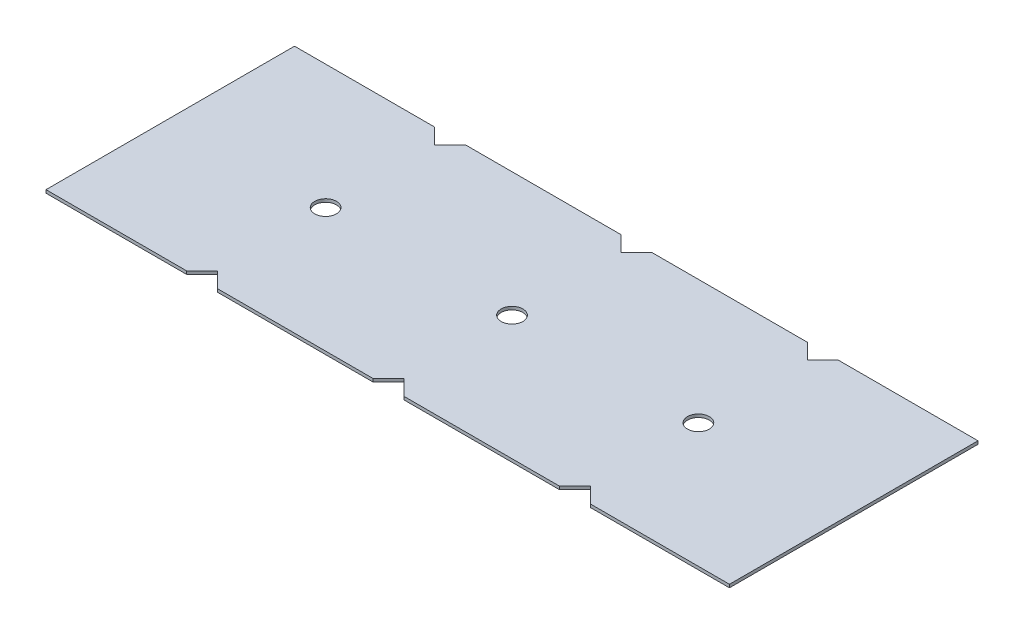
from build123d import *

# Parameters (mm, degrees)
ESQUISSE1_W                    = 220
ESQUISSE1_H                    = 1
EXTRUSION1_DEPTH               = 80
ESQUISSE3_R                    = 3.5
ENL_V_MAT_EXTRU_1_DEPTH        = 1
R_P_TITION_LIN_AIRE1_COUNT     = 2
R_P_TITION_LIN_AIRE1_PITCH     = 60
R_P_TITION_LIN_AIRE1_COL_COUNT = 2
R_P_TITION_LIN_AIRE1_COL_PITCH = 60
ENL_V_MAT_EXTRU_2_DEPTH        = 1
R_P_TITION_LIN_AIRE3_COUNT     = 2
R_P_TITION_LIN_AIRE3_PITCH     = 60
R_P_TITION_LIN_AIRE3_COL_COUNT = 2
R_P_TITION_LIN_AIRE3_COL_PITCH = 60
ENL_V_MAT_EXTRU_3_DEPTH        = 1
R_P_TITION_LIN_AIRE4_COUNT     = 2
R_P_TITION_LIN_AIRE4_PITCH     = 60
R_P_TITION_LIN_AIRE4_COL_COUNT = 2
R_P_TITION_LIN_AIRE4_COL_PITCH = 60


with BuildPart() as part:
    # Esquisse1 → Extrusion1 (new body)
    with BuildSketch(Plane.XY):
        with Locations((110, 0.5)):
            Rectangle(ESQUISSE1_W, ESQUISSE1_H)
    extrude(amount=-EXTRUSION1_DEPTH)

    # Esquisse3 → Enl_v. mat.-Extru.1 (cut)
    with BuildSketch(Plane(origin=(0, 1, 0), x_dir=(-1, 0, 0), z_dir=(0, 1, 0))):
        with Locations(Location((-110, -40, 0), (0, 0, 90))):
            Circle(ESQUISSE3_R)
    enl_v_mat_extru_1 = extrude(amount=-ENL_V_MAT_EXTRU_1_DEPTH, mode=Mode.SUBTRACT)

    # R_p_tition lin_aire1: Enl_v. mat.-Extru.1 ×2
    with Locations(*[(i * R_P_TITION_LIN_AIRE1_PITCH, 0, 0) for i in range(1, R_P_TITION_LIN_AIRE1_COUNT)]):
        add(enl_v_mat_extru_1, mode=Mode.SUBTRACT)

    # R_p_tition lin_aire1 col: Enl_v. mat.-Extru.1 ×2
    with Locations(*[(-i * R_P_TITION_LIN_AIRE1_COL_PITCH, 0, 0) for i in range(1, R_P_TITION_LIN_AIRE1_COL_COUNT)]):
        add(enl_v_mat_extru_1, mode=Mode.SUBTRACT)

    # Esquisse4 → Enl_v. mat.-Extru.2 (cut)
    with BuildSketch(Plane(origin=(0, 1, 0), x_dir=(-1, 0, 0), z_dir=(0, 1, 0))):
        Polygon((-115.07945654, -80), (-110.07945654, -75), (-105.07945654, -80), align=None)
    enl_v_mat_extru_2 = extrude(amount=-ENL_V_MAT_EXTRU_2_DEPTH, mode=Mode.SUBTRACT)

    # R_p_tition lin_aire3: Enl_v. mat.-Extru.2 ×2
    with Locations(*[(i * R_P_TITION_LIN_AIRE3_PITCH, 0, 0) for i in range(1, R_P_TITION_LIN_AIRE3_COUNT)]):
        add(enl_v_mat_extru_2, mode=Mode.SUBTRACT)

    # R_p_tition lin_aire3 col: Enl_v. mat.-Extru.2 ×2
    with Locations(*[(-i * R_P_TITION_LIN_AIRE3_COL_PITCH, 0, 0) for i in range(1, R_P_TITION_LIN_AIRE3_COL_COUNT)]):
        add(enl_v_mat_extru_2, mode=Mode.SUBTRACT)

    # Esquisse8 → Enl_v. mat.-Extru.3 (cut)
    with BuildSketch(Plane(origin=(0, 1, 0), x_dir=(-1, 0, 0), z_dir=(0, 1, 0))):
        Polygon((-110.280404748, -5), (-105.280404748, 0), (-115.280404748, 0), align=None)
    enl_v_mat_extru_3 = extrude(amount=-ENL_V_MAT_EXTRU_3_DEPTH, mode=Mode.SUBTRACT)

    # R_p_tition lin_aire4: Enl_v. mat.-Extru.3 ×2
    with Locations(*[(i * R_P_TITION_LIN_AIRE4_PITCH, 0, 0) for i in range(1, R_P_TITION_LIN_AIRE4_COUNT)]):
        add(enl_v_mat_extru_3, mode=Mode.SUBTRACT)

    # R_p_tition lin_aire4 col: Enl_v. mat.-Extru.3 ×2
    with Locations(*[(-i * R_P_TITION_LIN_AIRE4_COL_PITCH, 0, 0) for i in range(1, R_P_TITION_LIN_AIRE4_COL_COUNT)]):
        add(enl_v_mat_extru_3, mode=Mode.SUBTRACT)


solid = part.part
